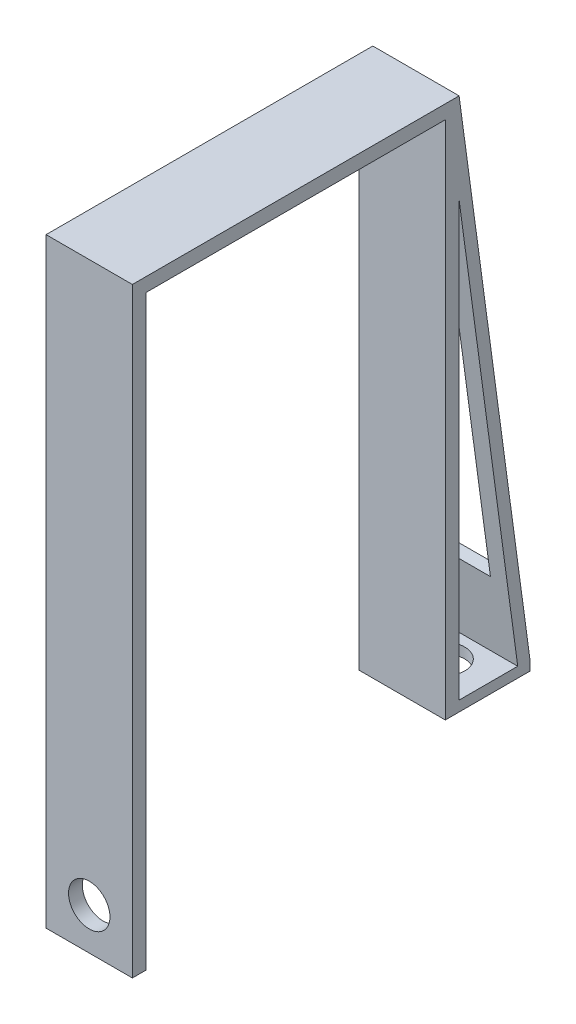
ISO-10303-21;
HEADER;
FILE_DESCRIPTION(('STEP AP214'),'2;1');
FILE_NAME('part.step','',(''),(''),'','','');
FILE_SCHEMA(('AUTOMOTIVE_DESIGN { 1 0 10303 214 1 1 1 1 }'));
ENDSEC;
DATA;
#1=APPLICATION_CONTEXT('core data for automotive mechanical design processes');
#2=APPLICATION_PROTOCOL_DEFINITION('international standard','automotive_design',2000,#1);
#3=PRODUCT_CONTEXT('',#1,'mechanical');
#4=PRODUCT('Part','Part','',(#3));
#5=PRODUCT_RELATED_PRODUCT_CATEGORY('part','',(#4));
#6=PRODUCT_DEFINITION_FORMATION('','',#4);
#7=PRODUCT_DEFINITION_CONTEXT('part definition',#1,'design');
#8=PRODUCT_DEFINITION('design','',#6,#7);
#9=PRODUCT_DEFINITION_SHAPE('','',#8);
#10=(LENGTH_UNIT() NAMED_UNIT(*) SI_UNIT(.MILLI.,.METRE.));
#11=(NAMED_UNIT(*) PLANE_ANGLE_UNIT() SI_UNIT($,.RADIAN.));
#12=(NAMED_UNIT(*) SI_UNIT($,.STERADIAN.) SOLID_ANGLE_UNIT());
#13=UNCERTAINTY_MEASURE_WITH_UNIT(LENGTH_MEASURE(1.E-05),#10,'distance_accuracy_value','');
#14=(GEOMETRIC_REPRESENTATION_CONTEXT(3) GLOBAL_UNCERTAINTY_ASSIGNED_CONTEXT((#13)) GLOBAL_UNIT_ASSIGNED_CONTEXT((#10,
#11,#12)) REPRESENTATION_CONTEXT('',''));
#15=CARTESIAN_POINT('',(0.,0.,0.));
#16=DIRECTION('',(0.,0.,1.));
#17=DIRECTION('',(1.,0.,0.));
#18=AXIS2_PLACEMENT_3D('',#15,#16,#17);
#19=CARTESIAN_POINT('',(0.,0.,-90.65));
#20=DIRECTION('',(0.,0.,-1.));
#21=DIRECTION('',(-1.,0.,0.));
#22=AXIS2_PLACEMENT_3D('',#19,#20,#21);
#23=PLANE('',#22);
#24=DIRECTION('',(1.,0.,0.));
#25=VECTOR('',#24,1.);
#26=CARTESIAN_POINT('',(-276.184979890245,50.4744148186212,-90.65));
#27=LINE('',#26,#25);
#28=CARTESIAN_POINT('',(-123.20341047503,50.4744148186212,-90.65));
#29=VERTEX_POINT('',#28);
#30=CARTESIAN_POINT('',(-118.20341047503,50.4744148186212,-90.65));
#31=VERTEX_POINT('',#30);
#32=EDGE_CURVE('E231',#29,#31,#27,.T.);
#33=ORIENTED_EDGE('',*,*,#32,.T.);
#34=CARTESIAN_POINT('',(-103.20341047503,50.4744148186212,-90.65));
#35=VERTEX_POINT('',#34);
#36=EDGE_CURVE('E235',#31,#35,#27,.T.);
#37=ORIENTED_EDGE('',*,*,#36,.T.);
#38=CARTESIAN_POINT('',(-98.2034104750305,50.4744148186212,-90.65));
#39=VERTEX_POINT('',#38);
#40=EDGE_CURVE('E184',#35,#39,#27,.T.);
#41=ORIENTED_EDGE('',*,*,#40,.T.);
#42=DIRECTION('',(0.,1.,0.));
#43=VECTOR('',#42,1.);
#44=CARTESIAN_POINT('',(-98.2034104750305,-78.0238733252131,-90.65));
#45=LINE('',#44,#43);
#46=CARTESIAN_POINT('',(-98.2034104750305,-75.0238733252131,-90.65));
#47=VERTEX_POINT('',#46);
#48=EDGE_CURVE('E274',#47,#39,#45,.T.);
#49=ORIENTED_EDGE('',*,*,#48,.F.);
#50=DIRECTION('',(-1.,0.,0.));
#51=VECTOR('',#50,1.);
#52=CARTESIAN_POINT('',(-77.4717781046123,-75.0238733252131,-90.65));
#53=LINE('',#52,#51);
#54=CARTESIAN_POINT('',(-123.20341047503,-75.0238733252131,-90.65));
#55=VERTEX_POINT('',#54);
#56=EDGE_CURVE('E252',#47,#55,#53,.T.);
#57=ORIENTED_EDGE('',*,*,#56,.T.);
#58=DIRECTION('',(0.,1.,0.));
#59=VECTOR('',#58,1.);
#60=CARTESIAN_POINT('',(-123.20341047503,-78.0238733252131,-90.65));
#61=LINE('',#60,#59);
#62=EDGE_CURVE('E269',#55,#29,#61,.T.);
#63=ORIENTED_EDGE('',*,*,#62,.T.);
#64=EDGE_LOOP('',(#33,#37,#41,#49,#57,#63));
#65=FACE_BOUND('',#64,.T.);
#66=ADVANCED_FACE('F44',(#65),#23,.T.);
#67=CARTESIAN_POINT('',(0.,0.,4.));
#68=DIRECTION('',(0.,0.,-1.));
#69=DIRECTION('',(-1.,0.,0.));
#70=AXIS2_PLACEMENT_3D('',#67,#68,#69);
#71=PLANE('',#70);
#72=DIRECTION('',(0.,-1.,0.));
#73=VECTOR('',#72,1.);
#74=CARTESIAN_POINT('',(-123.20341047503,-97.4238733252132,4.));
#75=LINE('',#74,#73);
#76=CARTESIAN_POINT('',(-123.20341047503,76.5761266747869,4.));
#77=VERTEX_POINT('',#76);
#78=CARTESIAN_POINT('',(-123.20341047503,-97.4238733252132,4.));
#79=VERTEX_POINT('',#78);
#80=EDGE_CURVE('E326',#77,#79,#75,.T.);
#81=ORIENTED_EDGE('',*,*,#80,.T.);
#82=DIRECTION('',(1.,0.,0.));
#83=VECTOR('',#82,1.);
#84=CARTESIAN_POINT('',(-123.20341047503,-97.4238733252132,4.));
#85=LINE('',#84,#83);
#86=CARTESIAN_POINT('',(-98.2034104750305,-97.4238733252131,4.));
#87=VERTEX_POINT('',#86);
#88=EDGE_CURVE('E330',#79,#87,#85,.T.);
#89=ORIENTED_EDGE('',*,*,#88,.T.);
#90=DIRECTION('',(0.,1.,0.));
#91=VECTOR('',#90,1.);
#92=CARTESIAN_POINT('',(-98.2034104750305,-97.4238733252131,4.));
#93=LINE('',#92,#91);
#94=CARTESIAN_POINT('',(-98.2034104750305,76.5761266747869,4.));
#95=VERTEX_POINT('',#94);
#96=EDGE_CURVE('E334',#87,#95,#93,.T.);
#97=ORIENTED_EDGE('',*,*,#96,.T.);
#98=DIRECTION('',(1.,0.,0.));
#99=VECTOR('',#98,1.);
#100=CARTESIAN_POINT('',(-123.20341047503,76.5761266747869,4.));
#101=LINE('',#100,#99);
#102=EDGE_CURVE('E299',#77,#95,#101,.T.);
#103=ORIENTED_EDGE('',*,*,#102,.F.);
#104=EDGE_LOOP('',(#81,#89,#97,#103));
#105=FACE_BOUND('',#104,.T.);
#106=CARTESIAN_POINT('',(-110.70341047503,-85.3745629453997,4.));
#107=DIRECTION('',(0.,0.,1.));
#108=DIRECTION('',(1.,0.,0.));
#109=AXIS2_PLACEMENT_3D('',#106,#107,#108);
#110=CIRCLE('',#109,6.);
#111=CARTESIAN_POINT('',(-104.70341047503,-85.3745629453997,4.));
#112=VERTEX_POINT('',#111);
#113=EDGE_CURVE('E318',#112,#112,#110,.T.);
#114=ORIENTED_EDGE('',*,*,#113,.F.);
#115=EDGE_LOOP('',(#114));
#116=FACE_BOUND('',#115,.T.);
#117=ADVANCED_FACE('F417',(#105,#116),#71,.F.);
#118=CARTESIAN_POINT('',(0.,0.,0.));
#119=DIRECTION('',(0.,0.,-1.));
#120=DIRECTION('',(-1.,0.,0.));
#121=AXIS2_PLACEMENT_3D('',#118,#119,#120);
#122=PLANE('',#121);
#123=DIRECTION('',(0.,-1.,0.));
#124=VECTOR('',#123,1.);
#125=CARTESIAN_POINT('',(-123.20341047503,-97.4238733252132,0.));
#126=LINE('',#125,#124);
#127=CARTESIAN_POINT('',(-123.20341047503,72.5761266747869,0.));
#128=VERTEX_POINT('',#127);
#129=CARTESIAN_POINT('',(-123.20341047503,-97.4238733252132,0.));
#130=VERTEX_POINT('',#129);
#131=EDGE_CURVE('E322',#128,#130,#126,.T.);
#132=ORIENTED_EDGE('',*,*,#131,.F.);
#133=DIRECTION('',(-1.,0.,0.));
#134=VECTOR('',#133,1.);
#135=CARTESIAN_POINT('',(-123.20341047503,72.5761266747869,0.));
#136=LINE('',#135,#134);
#137=CARTESIAN_POINT('',(-98.2034104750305,72.5761266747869,0.));
#138=VERTEX_POINT('',#137);
#139=EDGE_CURVE('E331',#138,#128,#136,.T.);
#140=ORIENTED_EDGE('',*,*,#139,.F.);
#141=DIRECTION('',(0.,1.,0.));
#142=VECTOR('',#141,1.);
#143=CARTESIAN_POINT('',(-98.2034104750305,-97.4238733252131,0.));
#144=LINE('',#143,#142);
#145=CARTESIAN_POINT('',(-98.2034104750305,-97.4238733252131,0.));
#146=VERTEX_POINT('',#145);
#147=EDGE_CURVE('E344',#146,#138,#144,.T.);
#148=ORIENTED_EDGE('',*,*,#147,.F.);
#149=DIRECTION('',(1.,0.,0.));
#150=VECTOR('',#149,1.);
#151=CARTESIAN_POINT('',(-123.20341047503,-97.4238733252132,0.));
#152=LINE('',#151,#150);
#153=EDGE_CURVE('E341',#130,#146,#152,.T.);
#154=ORIENTED_EDGE('',*,*,#153,.F.);
#155=EDGE_LOOP('',(#132,#140,#148,#154));
#156=FACE_BOUND('',#155,.T.);
#157=CARTESIAN_POINT('',(-110.70341047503,-85.3745629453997,0.));
#158=DIRECTION('',(0.,0.,1.));
#159=DIRECTION('',(1.,0.,0.));
#160=AXIS2_PLACEMENT_3D('',#157,#158,#159);
#161=CIRCLE('',#160,6.);
#162=CARTESIAN_POINT('',(-104.70341047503,-85.3745629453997,0.));
#163=VERTEX_POINT('',#162);
#164=EDGE_CURVE('E308',#163,#163,#161,.T.);
#165=ORIENTED_EDGE('',*,*,#164,.T.);
#166=EDGE_LOOP('',(#165));
#167=FACE_BOUND('',#166,.T.);
#168=ADVANCED_FACE('F392',(#156,#167),#122,.T.);
#169=CARTESIAN_POINT('',(-123.20341047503,-97.4238733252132,4.));
#170=DIRECTION('',(1.,0.,0.));
#171=DIRECTION('',(0.,0.,-1.));
#172=AXIS2_PLACEMENT_3D('',#169,#170,#171);
#173=PLANE('',#172);
#174=DIRECTION('',(0.,0.,1.));
#175=VECTOR('',#174,1.);
#176=CARTESIAN_POINT('',(-123.20341047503,76.5761266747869,4.));
#177=LINE('',#176,#175);
#178=CARTESIAN_POINT('',(-123.20341047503,76.5761266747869,-90.65));
#179=VERTEX_POINT('',#178);
#180=EDGE_CURVE('E295',#179,#77,#177,.T.);
#181=ORIENTED_EDGE('',*,*,#180,.F.);
#182=DIRECTION('',(0.,-0.990969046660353,-0.134090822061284));
#183=VECTOR('',#182,1.);
#184=CARTESIAN_POINT('',(-123.20341047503,76.5761266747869,-90.65));
#185=LINE('',#184,#183);
#186=CARTESIAN_POINT('',(-123.20341047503,-75.0238733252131,-111.163424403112));
#187=VERTEX_POINT('',#186);
#188=EDGE_CURVE('E215',#179,#187,#185,.T.);
#189=ORIENTED_EDGE('',*,*,#188,.T.);
#190=DIRECTION('',(0.,-1.,0.));
#191=VECTOR('',#190,1.);
#192=CARTESIAN_POINT('',(-123.20341047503,-78.0238733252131,-111.163424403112));
#193=LINE('',#192,#191);
#194=CARTESIAN_POINT('',(-123.20341047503,-78.0238733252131,-111.163424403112));
#195=VERTEX_POINT('',#194);
#196=EDGE_CURVE('E248',#187,#195,#193,.T.);
#197=ORIENTED_EDGE('',*,*,#196,.T.);
#198=DIRECTION('',(0.,0.,1.));
#199=VECTOR('',#198,1.);
#200=CARTESIAN_POINT('',(-123.20341047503,-78.0238733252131,-90.65));
#201=LINE('',#200,#199);
#202=CARTESIAN_POINT('',(-123.20341047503,-78.0238733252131,-86.65));
#203=VERTEX_POINT('',#202);
#204=EDGE_CURVE('E278',#195,#203,#201,.T.);
#205=ORIENTED_EDGE('',*,*,#204,.T.);
#206=DIRECTION('',(0.,1.,0.));
#207=VECTOR('',#206,1.);
#208=CARTESIAN_POINT('',(-123.20341047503,-78.0238733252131,-86.65));
#209=LINE('',#208,#207);
#210=CARTESIAN_POINT('',(-123.20341047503,72.5761266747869,-86.65));
#211=VERTEX_POINT('',#210);
#212=EDGE_CURVE('E264',#203,#211,#209,.T.);
#213=ORIENTED_EDGE('',*,*,#212,.T.);
#214=DIRECTION('',(0.,0.,1.));
#215=VECTOR('',#214,1.);
#216=CARTESIAN_POINT('',(-123.20341047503,72.5761266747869,4.));
#217=LINE('',#216,#215);
#218=EDGE_CURVE('E291',#211,#128,#217,.T.);
#219=ORIENTED_EDGE('',*,*,#218,.T.);
#220=ORIENTED_EDGE('',*,*,#131,.T.);
#221=DIRECTION('',(0.,0.,-1.));
#222=VECTOR('',#221,1.);
#223=CARTESIAN_POINT('',(-123.20341047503,-97.4238733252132,4.));
#224=LINE('',#223,#222);
#225=EDGE_CURVE('E353',#79,#130,#224,.T.);
#226=ORIENTED_EDGE('',*,*,#225,.F.);
#227=ORIENTED_EDGE('',*,*,#80,.F.);
#228=EDGE_LOOP('',(#181,#189,#197,#205,#213,#219,#220,#226,#227));
#229=FACE_BOUND('',#228,.T.);
#230=DIRECTION('',(0.,0.990969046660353,0.134090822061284));
#231=VECTOR('',#230,1.);
#232=CARTESIAN_POINT('',(-123.20341047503,-75.0238733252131,-107.631528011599));
#233=LINE('',#232,#231);
#234=CARTESIAN_POINT('',(-123.20341047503,-75.0238733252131,-107.631528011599));
#235=VERTEX_POINT('',#234);
#236=EDGE_CURVE('E219',#235,#29,#233,.T.);
#237=ORIENTED_EDGE('',*,*,#236,.T.);
#238=ORIENTED_EDGE('',*,*,#62,.F.);
#239=DIRECTION('',(0.,0.,-1.));
#240=VECTOR('',#239,1.);
#241=CARTESIAN_POINT('',(-123.20341047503,-75.0238733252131,-90.65));
#242=LINE('',#241,#240);
#243=EDGE_CURVE('E238',#55,#235,#242,.T.);
#244=ORIENTED_EDGE('',*,*,#243,.T.);
#245=EDGE_LOOP('',(#237,#238,#244));
#246=FACE_BOUND('',#245,.T.);
#247=ADVANCED_FACE('F46',(#229,#246),#173,.F.);
#248=CARTESIAN_POINT('',(-123.20341047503,-97.4238733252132,4.));
#249=DIRECTION('',(0.,1.,0.));
#250=DIRECTION('',(-1.,0.,0.));
#251=AXIS2_PLACEMENT_3D('',#248,#249,#250);
#252=PLANE('',#251);
#253=ORIENTED_EDGE('',*,*,#153,.T.);
#254=DIRECTION('',(0.,0.,-1.));
#255=VECTOR('',#254,1.);
#256=CARTESIAN_POINT('',(-98.2034104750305,-97.4238733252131,4.));
#257=LINE('',#256,#255);
#258=EDGE_CURVE('E337',#87,#146,#257,.T.);
#259=ORIENTED_EDGE('',*,*,#258,.F.);
#260=ORIENTED_EDGE('',*,*,#88,.F.);
#261=ORIENTED_EDGE('',*,*,#225,.T.);
#262=EDGE_LOOP('',(#253,#259,#260,#261));
#263=FACE_BOUND('',#262,.T.);
#264=ADVANCED_FACE('F382',(#263),#252,.F.);
#265=CARTESIAN_POINT('',(-98.2034104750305,-97.4238733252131,4.));
#266=DIRECTION('',(-1.,0.,0.));
#267=DIRECTION('',(0.,0.,1.));
#268=AXIS2_PLACEMENT_3D('',#265,#266,#267);
#269=PLANE('',#268);
#270=ORIENTED_EDGE('',*,*,#48,.T.);
#271=DIRECTION('',(0.,-0.990969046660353,-0.134090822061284));
#272=VECTOR('',#271,1.);
#273=CARTESIAN_POINT('',(-98.2034104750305,-75.0238733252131,-107.631528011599));
#274=LINE('',#273,#272);
#275=CARTESIAN_POINT('',(-98.2034104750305,-75.0238733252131,-107.631528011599));
#276=VERTEX_POINT('',#275);
#277=EDGE_CURVE('E221',#39,#276,#274,.T.);
#278=ORIENTED_EDGE('',*,*,#277,.T.);
#279=DIRECTION('',(0.,0.,1.));
#280=VECTOR('',#279,1.);
#281=CARTESIAN_POINT('',(-98.2034104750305,-75.0238733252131,-90.65));
#282=LINE('',#281,#280);
#283=EDGE_CURVE('E243',#276,#47,#282,.T.);
#284=ORIENTED_EDGE('',*,*,#283,.T.);
#285=EDGE_LOOP('',(#270,#278,#284));
#286=FACE_BOUND('',#285,.T.);
#287=ORIENTED_EDGE('',*,*,#147,.T.);
#288=DIRECTION('',(0.,0.,-1.));
#289=VECTOR('',#288,1.);
#290=CARTESIAN_POINT('',(-98.2034104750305,72.5761266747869,4.));
#291=LINE('',#290,#289);
#292=CARTESIAN_POINT('',(-98.2034104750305,72.5761266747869,-86.65));
#293=VERTEX_POINT('',#292);
#294=EDGE_CURVE('E312',#138,#293,#291,.T.);
#295=ORIENTED_EDGE('',*,*,#294,.T.);
#296=DIRECTION('',(0.,1.,0.));
#297=VECTOR('',#296,1.);
#298=CARTESIAN_POINT('',(-98.2034104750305,-78.0238733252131,-86.65));
#299=LINE('',#298,#297);
#300=CARTESIAN_POINT('',(-98.2034104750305,-78.0238733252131,-86.65));
#301=VERTEX_POINT('',#300);
#302=EDGE_CURVE('E270',#301,#293,#299,.T.);
#303=ORIENTED_EDGE('',*,*,#302,.F.);
#304=DIRECTION('',(0.,0.,1.));
#305=VECTOR('',#304,1.);
#306=CARTESIAN_POINT('',(-98.2034104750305,-78.0238733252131,-90.65));
#307=LINE('',#306,#305);
#308=CARTESIAN_POINT('',(-98.2034104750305,-78.0238733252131,-111.163424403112));
#309=VERTEX_POINT('',#308);
#310=EDGE_CURVE('E288',#309,#301,#307,.T.);
#311=ORIENTED_EDGE('',*,*,#310,.F.);
#312=DIRECTION('',(0.,1.,0.));
#313=VECTOR('',#312,1.);
#314=CARTESIAN_POINT('',(-98.2034104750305,-78.0238733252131,-111.163424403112));
#315=LINE('',#314,#313);
#316=CARTESIAN_POINT('',(-98.2034104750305,-75.0238733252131,-111.163424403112));
#317=VERTEX_POINT('',#316);
#318=EDGE_CURVE('E239',#309,#317,#315,.T.);
#319=ORIENTED_EDGE('',*,*,#318,.T.);
#320=DIRECTION('',(0.,0.990969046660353,0.134090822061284));
#321=VECTOR('',#320,1.);
#322=CARTESIAN_POINT('',(-98.2034104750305,76.5761266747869,-90.65));
#323=LINE('',#322,#321);
#324=CARTESIAN_POINT('',(-98.2034104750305,76.5761266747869,-90.65));
#325=VERTEX_POINT('',#324);
#326=EDGE_CURVE('E225',#317,#325,#323,.T.);
#327=ORIENTED_EDGE('',*,*,#326,.T.);
#328=DIRECTION('',(0.,0.,-1.));
#329=VECTOR('',#328,1.);
#330=CARTESIAN_POINT('',(-98.2034104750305,76.5761266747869,4.));
#331=LINE('',#330,#329);
#332=EDGE_CURVE('E304',#95,#325,#331,.T.);
#333=ORIENTED_EDGE('',*,*,#332,.F.);
#334=ORIENTED_EDGE('',*,*,#96,.F.);
#335=ORIENTED_EDGE('',*,*,#258,.T.);
#336=EDGE_LOOP('',(#287,#295,#303,#311,#319,#327,#333,#334,#335));
#337=FACE_BOUND('',#336,.T.);
#338=ADVANCED_FACE('F376',(#286,#337),#269,.F.);
#339=CARTESIAN_POINT('',(-110.70341047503,-85.3745629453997,4.));
#340=DIRECTION('',(0.,0.,-1.));
#341=DIRECTION('',(-1.,0.,0.));
#342=AXIS2_PLACEMENT_3D('',#339,#340,#341);
#343=CYLINDRICAL_SURFACE('',#342,6.);
#344=ORIENTED_EDGE('',*,*,#113,.T.);
#345=EDGE_LOOP('',(#344));
#346=FACE_BOUND('',#345,.T.);
#347=ORIENTED_EDGE('',*,*,#164,.F.);
#348=EDGE_LOOP('',(#347));
#349=FACE_BOUND('',#348,.T.);
#350=ADVANCED_FACE('F381',(#346,#349),#343,.F.);
#351=CARTESIAN_POINT('',(0.,76.5761266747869,0.));
#352=DIRECTION('',(0.,-1.,0.));
#353=DIRECTION('',(0.,0.,-1.));
#354=AXIS2_PLACEMENT_3D('',#351,#352,#353);
#355=PLANE('',#354);
#356=ORIENTED_EDGE('',*,*,#180,.T.);
#357=ORIENTED_EDGE('',*,*,#102,.T.);
#358=ORIENTED_EDGE('',*,*,#332,.T.);
#359=DIRECTION('',(-1.,0.,0.));
#360=VECTOR('',#359,1.);
#361=CARTESIAN_POINT('',(-98.2034104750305,76.5761266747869,-90.65));
#362=LINE('',#361,#360);
#363=EDGE_CURVE('E265',#325,#179,#362,.T.);
#364=ORIENTED_EDGE('',*,*,#363,.T.);
#365=EDGE_LOOP('',(#356,#357,#358,#364));
#366=FACE_BOUND('',#365,.T.);
#367=ADVANCED_FACE('F414',(#366),#355,.F.);
#368=CARTESIAN_POINT('',(0.,72.5761266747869,0.));
#369=DIRECTION('',(0.,-1.,0.));
#370=DIRECTION('',(0.,0.,-1.));
#371=AXIS2_PLACEMENT_3D('',#368,#369,#370);
#372=PLANE('',#371);
#373=ORIENTED_EDGE('',*,*,#294,.F.);
#374=ORIENTED_EDGE('',*,*,#139,.T.);
#375=ORIENTED_EDGE('',*,*,#218,.F.);
#376=DIRECTION('',(-1.,0.,0.));
#377=VECTOR('',#376,1.);
#378=CARTESIAN_POINT('',(-123.20341047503,72.5761266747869,-86.65));
#379=LINE('',#378,#377);
#380=EDGE_CURVE('E300',#293,#211,#379,.T.);
#381=ORIENTED_EDGE('',*,*,#380,.F.);
#382=EDGE_LOOP('',(#373,#374,#375,#381));
#383=FACE_BOUND('',#382,.T.);
#384=ADVANCED_FACE('F395',(#383),#372,.T.);
#385=CARTESIAN_POINT('',(0.,0.,-86.65));
#386=DIRECTION('',(0.,0.,-1.));
#387=DIRECTION('',(-1.,0.,0.));
#388=AXIS2_PLACEMENT_3D('',#385,#386,#387);
#389=PLANE('',#388);
#390=ORIENTED_EDGE('',*,*,#302,.T.);
#391=ORIENTED_EDGE('',*,*,#380,.T.);
#392=ORIENTED_EDGE('',*,*,#212,.F.);
#393=DIRECTION('',(-1.,0.,0.));
#394=VECTOR('',#393,1.);
#395=CARTESIAN_POINT('',(-98.2034104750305,-78.0238733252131,-86.65));
#396=LINE('',#395,#394);
#397=EDGE_CURVE('E282',#301,#203,#396,.T.);
#398=ORIENTED_EDGE('',*,*,#397,.F.);
#399=EDGE_LOOP('',(#390,#391,#392,#398));
#400=FACE_BOUND('',#399,.T.);
#401=ADVANCED_FACE('F399',(#400),#389,.F.);
#402=CARTESIAN_POINT('',(-98.2034104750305,-78.0238733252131,-90.65));
#403=DIRECTION('',(0.,1.,0.));
#404=DIRECTION('',(0.,0.,1.));
#405=AXIS2_PLACEMENT_3D('',#402,#403,#404);
#406=PLANE('',#405);
#407=CARTESIAN_POINT('',(-110.70341047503,-78.0238733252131,-98.7817122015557));
#408=DIRECTION('',(0.,-1.,0.));
#409=DIRECTION('',(0.,0.,-1.));
#410=AXIS2_PLACEMENT_3D('',#407,#408,#409);
#411=CIRCLE('',#410,6.);
#412=CARTESIAN_POINT('',(-110.70341047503,-78.0238733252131,-104.781712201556));
#413=VERTEX_POINT('',#412);
#414=EDGE_CURVE('E210',#413,#413,#411,.T.);
#415=ORIENTED_EDGE('',*,*,#414,.F.);
#416=EDGE_LOOP('',(#415));
#417=FACE_BOUND('',#416,.T.);
#418=ORIENTED_EDGE('',*,*,#397,.T.);
#419=ORIENTED_EDGE('',*,*,#204,.F.);
#420=DIRECTION('',(-1.,0.,0.));
#421=VECTOR('',#420,1.);
#422=CARTESIAN_POINT('',(-77.4717781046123,-78.0238733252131,-111.163424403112));
#423=LINE('',#422,#421);
#424=EDGE_CURVE('E244',#309,#195,#423,.T.);
#425=ORIENTED_EDGE('',*,*,#424,.F.);
#426=ORIENTED_EDGE('',*,*,#310,.T.);
#427=EDGE_LOOP('',(#418,#419,#425,#426));
#428=FACE_BOUND('',#427,.T.);
#429=ADVANCED_FACE('F407',(#417,#428),#406,.F.);
#430=CARTESIAN_POINT('',(-77.4717781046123,-78.0238733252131,-111.163424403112));
#431=DIRECTION('',(0.,0.,-1.));
#432=DIRECTION('',(-1.,0.,0.));
#433=AXIS2_PLACEMENT_3D('',#430,#431,#432);
#434=PLANE('',#433);
#435=ORIENTED_EDGE('',*,*,#318,.F.);
#436=ORIENTED_EDGE('',*,*,#424,.T.);
#437=ORIENTED_EDGE('',*,*,#196,.F.);
#438=DIRECTION('',(-1.,0.,0.));
#439=VECTOR('',#438,1.);
#440=CARTESIAN_POINT('',(-77.4717781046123,-75.0238733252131,-111.163424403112));
#441=LINE('',#440,#439);
#442=EDGE_CURVE('E256',#317,#187,#441,.T.);
#443=ORIENTED_EDGE('',*,*,#442,.F.);
#444=EDGE_LOOP('',(#435,#436,#437,#443));
#445=FACE_BOUND('',#444,.T.);
#446=ADVANCED_FACE('F405',(#445),#434,.T.);
#447=CARTESIAN_POINT('',(-77.4717781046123,-75.0238733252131,-90.65));
#448=DIRECTION('',(0.,1.,0.));
#449=DIRECTION('',(0.,0.,1.));
#450=AXIS2_PLACEMENT_3D('',#447,#448,#449);
#451=PLANE('',#450);
#452=CARTESIAN_POINT('',(-110.70341047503,-75.0238733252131,-98.7817122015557));
#453=DIRECTION('',(0.,1.,0.));
#454=DIRECTION('',(0.,0.,1.));
#455=AXIS2_PLACEMENT_3D('',#452,#453,#454);
#456=CIRCLE('',#455,6.);
#457=CARTESIAN_POINT('',(-110.70341047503,-75.0238733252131,-92.7817122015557));
#458=VERTEX_POINT('',#457);
#459=EDGE_CURVE('E214',#458,#458,#456,.T.);
#460=ORIENTED_EDGE('',*,*,#459,.F.);
#461=EDGE_LOOP('',(#460));
#462=FACE_BOUND('',#461,.T.);
#463=DIRECTION('',(1.,0.,0.));
#464=VECTOR('',#463,1.);
#465=CARTESIAN_POINT('',(-276.184979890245,-75.0238733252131,-107.631528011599));
#466=LINE('',#465,#464);
#467=EDGE_CURVE('E220',#235,#276,#466,.T.);
#468=ORIENTED_EDGE('',*,*,#467,.F.);
#469=ORIENTED_EDGE('',*,*,#243,.F.);
#470=ORIENTED_EDGE('',*,*,#56,.F.);
#471=ORIENTED_EDGE('',*,*,#283,.F.);
#472=EDGE_LOOP('',(#468,#469,#470,#471));
#473=FACE_BOUND('',#472,.T.);
#474=ADVANCED_FACE('F374',(#462,#473),#451,.T.);
#475=CARTESIAN_POINT('',(-276.184979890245,76.5761266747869,-90.65));
#476=DIRECTION('',(0.,0.134090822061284,-0.990969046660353));
#477=DIRECTION('',(0.,0.990969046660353,0.134090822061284));
#478=AXIS2_PLACEMENT_3D('',#475,#476,#477);
#479=PLANE('',#478);
#480=DIRECTION('',(0.,0.990969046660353,0.134090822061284));
#481=VECTOR('',#480,1.);
#482=CARTESIAN_POINT('',(-118.20341047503,76.5761266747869,-90.65));
#483=LINE('',#482,#481);
#484=CARTESIAN_POINT('',(-118.20341047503,-53.1128648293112,-108.198583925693));
#485=VERTEX_POINT('',#484);
#486=CARTESIAN_POINT('',(-118.20341047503,51.2944926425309,-94.0709293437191));
#487=VERTEX_POINT('',#486);
#488=EDGE_CURVE('E207',#485,#487,#483,.T.);
#489=ORIENTED_EDGE('',*,*,#488,.F.);
#490=DIRECTION('',(-1.,0.,0.));
#491=VECTOR('',#490,1.);
#492=CARTESIAN_POINT('',(-276.184979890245,-53.1128648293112,-108.198583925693));
#493=LINE('',#492,#491);
#494=CARTESIAN_POINT('',(-103.20341047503,-53.1128648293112,-108.198583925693));
#495=VERTEX_POINT('',#494);
#496=EDGE_CURVE('E198',#495,#485,#493,.T.);
#497=ORIENTED_EDGE('',*,*,#496,.F.);
#498=DIRECTION('',(0.,-0.990969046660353,-0.134090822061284));
#499=VECTOR('',#498,1.);
#500=CARTESIAN_POINT('',(-103.20341047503,76.5761266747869,-90.65));
#501=LINE('',#500,#499);
#502=CARTESIAN_POINT('',(-103.20341047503,51.2944926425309,-94.0709293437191));
#503=VERTEX_POINT('',#502);
#504=EDGE_CURVE('E168',#503,#495,#501,.T.);
#505=ORIENTED_EDGE('',*,*,#504,.F.);
#506=DIRECTION('',(1.,0.,0.));
#507=VECTOR('',#506,1.);
#508=CARTESIAN_POINT('',(-276.184979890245,51.2944926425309,-94.0709293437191));
#509=LINE('',#508,#507);
#510=EDGE_CURVE('E11',#487,#503,#509,.T.);
#511=ORIENTED_EDGE('',*,*,#510,.F.);
#512=EDGE_LOOP('',(#489,#497,#505,#511));
#513=FACE_BOUND('',#512,.T.);
#514=ORIENTED_EDGE('',*,*,#188,.F.);
#515=ORIENTED_EDGE('',*,*,#363,.F.);
#516=ORIENTED_EDGE('',*,*,#326,.F.);
#517=ORIENTED_EDGE('',*,*,#442,.T.);
#518=EDGE_LOOP('',(#514,#515,#516,#517));
#519=FACE_BOUND('',#518,.T.);
#520=ADVANCED_FACE('F411',(#513,#519),#479,.T.);
#521=CARTESIAN_POINT('',(-276.184979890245,-75.0238733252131,-107.631528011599));
#522=DIRECTION('',(0.,-0.134090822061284,0.990969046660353));
#523=DIRECTION('',(0.,-0.990969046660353,-0.134090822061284));
#524=AXIS2_PLACEMENT_3D('',#521,#522,#523);
#525=PLANE('',#524);
#526=DIRECTION('',(0.,-0.990969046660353,-0.134090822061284));
#527=VECTOR('',#526,1.);
#528=CARTESIAN_POINT('',(-118.20341047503,-75.0238733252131,-107.631528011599));
#529=LINE('',#528,#527);
#530=CARTESIAN_POINT('',(-118.20341047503,-53.5821827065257,-104.730192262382));
#531=VERTEX_POINT('',#530);
#532=EDGE_CURVE('E53',#31,#531,#529,.T.);
#533=ORIENTED_EDGE('',*,*,#532,.F.);
#534=ORIENTED_EDGE('',*,*,#32,.F.);
#535=ORIENTED_EDGE('',*,*,#236,.F.);
#536=ORIENTED_EDGE('',*,*,#467,.T.);
#537=ORIENTED_EDGE('',*,*,#277,.F.);
#538=ORIENTED_EDGE('',*,*,#40,.F.);
#539=DIRECTION('',(0.,0.990969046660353,0.134090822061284));
#540=VECTOR('',#539,1.);
#541=CARTESIAN_POINT('',(-103.20341047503,-53.5821827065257,-104.730192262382));
#542=LINE('',#541,#540);
#543=CARTESIAN_POINT('',(-103.20341047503,-53.5821827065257,-104.730192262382));
#544=VERTEX_POINT('',#543);
#545=EDGE_CURVE('E164',#544,#35,#542,.T.);
#546=ORIENTED_EDGE('',*,*,#545,.F.);
#547=DIRECTION('',(1.,0.,0.));
#548=VECTOR('',#547,1.);
#549=CARTESIAN_POINT('',(-118.20341047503,-53.5821827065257,-104.730192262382));
#550=LINE('',#549,#548);
#551=EDGE_CURVE('E174',#531,#544,#550,.T.);
#552=ORIENTED_EDGE('',*,*,#551,.F.);
#553=EDGE_LOOP('',(#533,#534,#535,#536,#537,#538,#546,#552));
#554=FACE_BOUND('',#553,.T.);
#555=ADVANCED_FACE('F182',(#554),#525,.T.);
#556=CARTESIAN_POINT('',(-110.70341047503,-74.0238733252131,-98.7817122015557));
#557=DIRECTION('',(0.,-1.,0.));
#558=DIRECTION('',(0.,0.,-1.));
#559=AXIS2_PLACEMENT_3D('',#556,#557,#558);
#560=CYLINDRICAL_SURFACE('',#559,6.);
#561=ORIENTED_EDGE('',*,*,#459,.T.);
#562=EDGE_LOOP('',(#561));
#563=FACE_BOUND('',#562,.T.);
#564=ORIENTED_EDGE('',*,*,#414,.T.);
#565=EDGE_LOOP('',(#564));
#566=FACE_BOUND('',#565,.T.);
#567=ADVANCED_FACE('F506',(#563,#566),#560,.F.);
#568=CARTESIAN_POINT('',(-118.20341047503,-52.2412744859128,-114.639882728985));
#569=DIRECTION('',(-1.,0.,0.));
#570=DIRECTION('',(0.,0.,1.));
#571=AXIS2_PLACEMENT_3D('',#568,#569,#570);
#572=PLANE('',#571);
#573=ORIENTED_EDGE('',*,*,#488,.T.);
#574=DIRECTION('',(0.,-0.134090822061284,0.990969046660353));
#575=VECTOR('',#574,1.);
#576=CARTESIAN_POINT('',(-118.20341047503,52.1660829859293,-100.512228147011));
#577=LINE('',#576,#575);
#578=CARTESIAN_POINT('',(-118.20341047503,50.8251747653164,-90.6025376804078));
#579=VERTEX_POINT('',#578);
#580=EDGE_CURVE('E195',#487,#579,#577,.T.);
#581=ORIENTED_EDGE('',*,*,#580,.T.);
#582=DIRECTION('',(0.,-0.990969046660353,-0.134090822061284));
#583=VECTOR('',#582,1.);
#584=CARTESIAN_POINT('',(-118.20341047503,-53.5821827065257,-104.730192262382));
#585=LINE('',#584,#583);
#586=EDGE_CURVE('E180',#579,#31,#585,.T.);
#587=ORIENTED_EDGE('',*,*,#586,.T.);
#588=ORIENTED_EDGE('',*,*,#532,.T.);
#589=DIRECTION('',(0.,-0.134090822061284,0.990969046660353));
#590=VECTOR('',#589,1.);
#591=CARTESIAN_POINT('',(-118.20341047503,-52.2412744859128,-114.639882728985));
#592=LINE('',#591,#590);
#593=EDGE_CURVE('E65',#485,#531,#592,.T.);
#594=ORIENTED_EDGE('',*,*,#593,.F.);
#595=EDGE_LOOP('',(#573,#581,#587,#588,#594));
#596=FACE_BOUND('',#595,.T.);
#597=ADVANCED_FACE('F362',(#596),#572,.F.);
#598=CARTESIAN_POINT('',(-118.20341047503,52.1660829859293,-100.512228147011));
#599=DIRECTION('',(0.,0.990969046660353,0.134090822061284));
#600=DIRECTION('',(0.,-0.134090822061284,0.990969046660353));
#601=AXIS2_PLACEMENT_3D('',#598,#599,#600);
#602=PLANE('',#601);
#603=ORIENTED_EDGE('',*,*,#510,.T.);
#604=DIRECTION('',(0.,-0.134090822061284,0.990969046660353));
#605=VECTOR('',#604,1.);
#606=CARTESIAN_POINT('',(-103.20341047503,52.1660829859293,-100.512228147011));
#607=LINE('',#606,#605);
#608=CARTESIAN_POINT('',(-103.20341047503,50.8251747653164,-90.6025376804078));
#609=VERTEX_POINT('',#608);
#610=EDGE_CURVE('E171',#503,#609,#607,.T.);
#611=ORIENTED_EDGE('',*,*,#610,.T.);
#612=DIRECTION('',(-1.,0.,0.));
#613=VECTOR('',#612,1.);
#614=CARTESIAN_POINT('',(-118.20341047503,50.8251747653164,-90.6025376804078));
#615=LINE('',#614,#613);
#616=EDGE_CURVE('E187',#609,#579,#615,.T.);
#617=ORIENTED_EDGE('',*,*,#616,.T.);
#618=ORIENTED_EDGE('',*,*,#580,.F.);
#619=EDGE_LOOP('',(#603,#611,#617,#618));
#620=FACE_BOUND('',#619,.T.);
#621=ADVANCED_FACE('F543',(#620),#602,.F.);
#622=CARTESIAN_POINT('',(-103.20341047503,-52.2412744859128,-114.639882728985));
#623=DIRECTION('',(1.,0.,0.));
#624=DIRECTION('',(0.,0.,-1.));
#625=AXIS2_PLACEMENT_3D('',#622,#623,#624);
#626=PLANE('',#625);
#627=ORIENTED_EDGE('',*,*,#504,.T.);
#628=DIRECTION('',(0.,-0.134090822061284,0.990969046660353));
#629=VECTOR('',#628,1.);
#630=CARTESIAN_POINT('',(-103.20341047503,-52.2412744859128,-114.639882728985));
#631=LINE('',#630,#629);
#632=EDGE_CURVE('E60',#495,#544,#631,.T.);
#633=ORIENTED_EDGE('',*,*,#632,.T.);
#634=ORIENTED_EDGE('',*,*,#545,.T.);
#635=EDGE_CURVE('E179',#35,#609,#542,.T.);
#636=ORIENTED_EDGE('',*,*,#635,.T.);
#637=ORIENTED_EDGE('',*,*,#610,.F.);
#638=EDGE_LOOP('',(#627,#633,#634,#636,#637));
#639=FACE_BOUND('',#638,.T.);
#640=ADVANCED_FACE('F161',(#639),#626,.F.);
#641=CARTESIAN_POINT('',(-118.20341047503,-52.2412744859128,-114.639882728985));
#642=DIRECTION('',(0.,-0.990969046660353,-0.134090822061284));
#643=DIRECTION('',(0.,0.134090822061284,-0.990969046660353));
#644=AXIS2_PLACEMENT_3D('',#641,#642,#643);
#645=PLANE('',#644);
#646=ORIENTED_EDGE('',*,*,#496,.T.);
#647=ORIENTED_EDGE('',*,*,#593,.T.);
#648=ORIENTED_EDGE('',*,*,#551,.T.);
#649=ORIENTED_EDGE('',*,*,#632,.F.);
#650=EDGE_LOOP('',(#646,#647,#648,#649));
#651=FACE_BOUND('',#650,.T.);
#652=ADVANCED_FACE('F175',(#651),#645,.F.);
#653=CARTESIAN_POINT('',(0.,12.9531063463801,-95.7271142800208));
#654=DIRECTION('',(0.,0.134090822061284,-0.990969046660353));
#655=DIRECTION('',(0.,0.990969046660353,0.134090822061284));
#656=AXIS2_PLACEMENT_3D('',#653,#654,#655);
#657=PLANE('',#656);
#658=ORIENTED_EDGE('',*,*,#586,.F.);
#659=ORIENTED_EDGE('',*,*,#616,.F.);
#660=ORIENTED_EDGE('',*,*,#635,.F.);
#661=ORIENTED_EDGE('',*,*,#36,.F.);
#662=EDGE_LOOP('',(#658,#659,#660,#661));
#663=FACE_BOUND('',#662,.T.);
#664=ADVANCED_FACE('F572',(#663),#657,.T.);
#665=CLOSED_SHELL('',(#66,#117,#168,#247,#264,#338,#350,#367,#384,#401,#429,#446,#474,#520,#555,
#567,#597,#621,#640,#652,#664));
#666=MANIFOLD_SOLID_BREP('B2',#665);
#667=ADVANCED_BREP_SHAPE_REPRESENTATION('',(#18,#666),#14);
#668=SHAPE_DEFINITION_REPRESENTATION(#9,#667);
ENDSEC;
END-ISO-10303-21;
